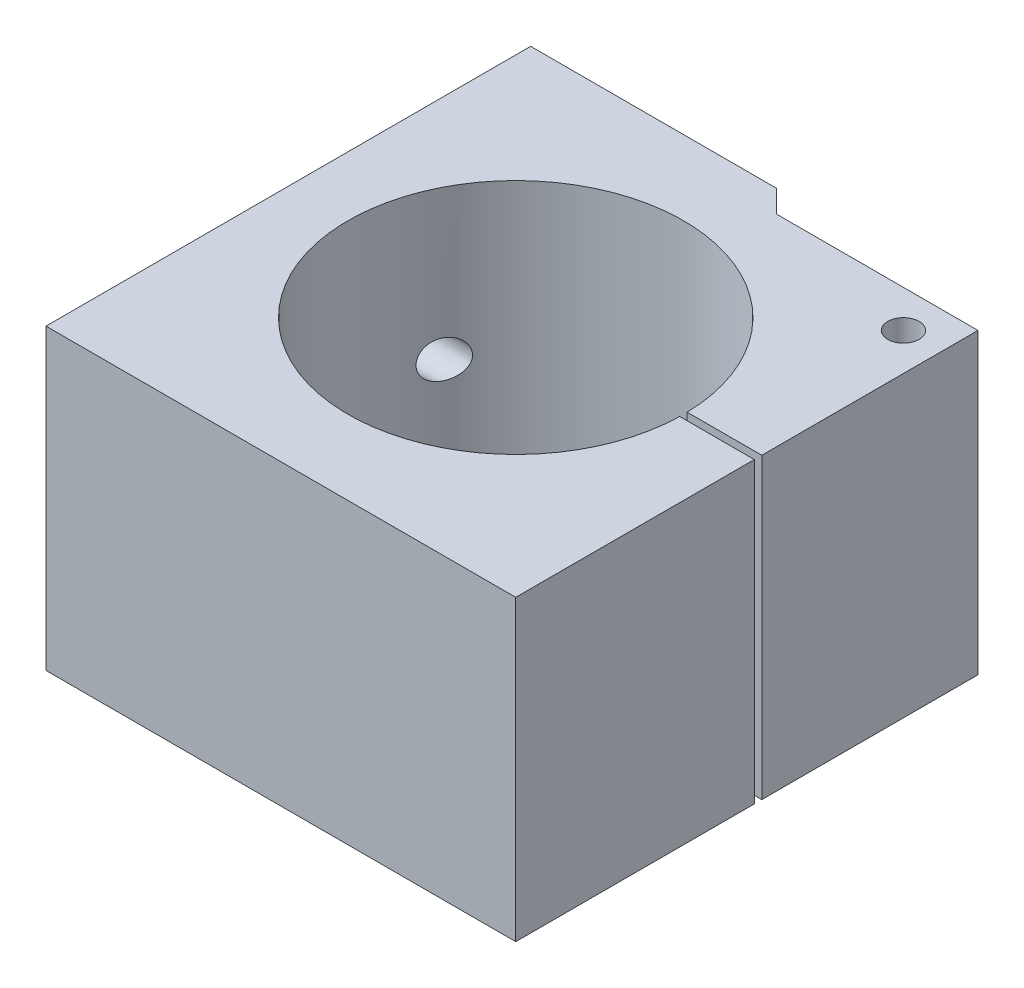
ISO-10303-21;
HEADER;
FILE_DESCRIPTION(('STEP AP214'),'2;1');
FILE_NAME('part.step','',(''),(''),'','','');
FILE_SCHEMA(('AUTOMOTIVE_DESIGN { 1 0 10303 214 1 1 1 1 }'));
ENDSEC;
DATA;
#1=APPLICATION_CONTEXT('core data for automotive mechanical design processes');
#2=APPLICATION_PROTOCOL_DEFINITION('international standard','automotive_design',2000,#1);
#3=PRODUCT_CONTEXT('',#1,'mechanical');
#4=PRODUCT('Part','Part','',(#3));
#5=PRODUCT_RELATED_PRODUCT_CATEGORY('part','',(#4));
#6=PRODUCT_DEFINITION_FORMATION('','',#4);
#7=PRODUCT_DEFINITION_CONTEXT('part definition',#1,'design');
#8=PRODUCT_DEFINITION('design','',#6,#7);
#9=PRODUCT_DEFINITION_SHAPE('','',#8);
#10=(LENGTH_UNIT() NAMED_UNIT(*) SI_UNIT(.MILLI.,.METRE.));
#11=(NAMED_UNIT(*) PLANE_ANGLE_UNIT() SI_UNIT($,.RADIAN.));
#12=(NAMED_UNIT(*) SI_UNIT($,.STERADIAN.) SOLID_ANGLE_UNIT());
#13=UNCERTAINTY_MEASURE_WITH_UNIT(LENGTH_MEASURE(1.E-05),#10,'distance_accuracy_value','');
#14=(GEOMETRIC_REPRESENTATION_CONTEXT(3) GLOBAL_UNCERTAINTY_ASSIGNED_CONTEXT((#13)) GLOBAL_UNIT_ASSIGNED_CONTEXT((#10,
#11,#12)) REPRESENTATION_CONTEXT('',''));
#15=CARTESIAN_POINT('',(0.,0.,0.));
#16=DIRECTION('',(0.,0.,1.));
#17=DIRECTION('',(1.,0.,0.));
#18=AXIS2_PLACEMENT_3D('',#15,#16,#17);
#19=CARTESIAN_POINT('',(32.5,40.,32.5));
#20=DIRECTION('',(-1.,0.,0.));
#21=DIRECTION('',(0.,0.,1.));
#22=AXIS2_PLACEMENT_3D('',#19,#20,#21);
#23=PLANE('',#22);
#24=DIRECTION('',(0.,-1.,0.));
#25=VECTOR('',#24,1.);
#26=CARTESIAN_POINT('',(32.5,40.,-29.5));
#27=LINE('',#26,#25);
#28=CARTESIAN_POINT('',(32.5,40.,-29.5));
#29=VERTEX_POINT('',#28);
#30=CARTESIAN_POINT('',(32.5,0.,-29.5));
#31=VERTEX_POINT('',#30);
#32=EDGE_CURVE('E258',#29,#31,#27,.T.);
#33=ORIENTED_EDGE('',*,*,#32,.F.);
#34=DIRECTION('',(0.,0.,-1.));
#35=VECTOR('',#34,1.);
#36=CARTESIAN_POINT('',(32.5,40.,32.5));
#37=LINE('',#36,#35);
#38=CARTESIAN_POINT('',(32.5,40.,-0.500000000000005));
#39=VERTEX_POINT('',#38);
#40=EDGE_CURVE('E252',#39,#29,#37,.T.);
#41=ORIENTED_EDGE('',*,*,#40,.F.);
#42=DIRECTION('',(0.,1.,0.));
#43=VECTOR('',#42,1.);
#44=CARTESIAN_POINT('',(32.5,0.,-0.500000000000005));
#45=LINE('',#44,#43);
#46=CARTESIAN_POINT('',(32.5,0.,-0.500000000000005));
#47=VERTEX_POINT('',#46);
#48=EDGE_CURVE('E281',#47,#39,#45,.T.);
#49=ORIENTED_EDGE('',*,*,#48,.F.);
#50=DIRECTION('',(0.,0.,-1.));
#51=VECTOR('',#50,1.);
#52=CARTESIAN_POINT('',(32.5,0.,32.5));
#53=LINE('',#52,#51);
#54=EDGE_CURVE('E243',#47,#31,#53,.T.);
#55=ORIENTED_EDGE('',*,*,#54,.T.);
#56=EDGE_LOOP('',(#33,#41,#49,#55));
#57=FACE_BOUND('',#56,.T.);
#58=ADVANCED_FACE('F43',(#57),#23,.F.);
#59=CARTESIAN_POINT('',(-32.5,40.,-32.5));
#60=DIRECTION('',(0.,0.,1.));
#61=DIRECTION('',(1.,0.,0.));
#62=AXIS2_PLACEMENT_3D('',#59,#60,#61);
#63=PLANE('',#62);
#64=DIRECTION('',(-1.,0.,0.));
#65=VECTOR('',#64,1.);
#66=CARTESIAN_POINT('',(-32.5,40.,-32.5));
#67=LINE('',#66,#65);
#68=CARTESIAN_POINT('',(2.49999999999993,40.,-32.5));
#69=VERTEX_POINT('',#68);
#70=CARTESIAN_POINT('',(-30.5,40.,-32.5));
#71=VERTEX_POINT('',#70);
#72=EDGE_CURVE('E121',#69,#71,#67,.T.);
#73=ORIENTED_EDGE('',*,*,#72,.F.);
#74=DIRECTION('',(0.,-1.,0.));
#75=VECTOR('',#74,1.);
#76=CARTESIAN_POINT('',(2.49999999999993,40.,-32.5));
#77=LINE('',#76,#75);
#78=CARTESIAN_POINT('',(2.49999999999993,0.,-32.5));
#79=VERTEX_POINT('',#78);
#80=EDGE_CURVE('E255',#69,#79,#77,.T.);
#81=ORIENTED_EDGE('',*,*,#80,.T.);
#82=DIRECTION('',(-1.,0.,0.));
#83=VECTOR('',#82,1.);
#84=CARTESIAN_POINT('',(-32.5,0.,-32.5));
#85=LINE('',#84,#83);
#86=CARTESIAN_POINT('',(-30.5,0.,-32.5));
#87=VERTEX_POINT('',#86);
#88=EDGE_CURVE('E136',#79,#87,#85,.T.);
#89=ORIENTED_EDGE('',*,*,#88,.T.);
#90=DIRECTION('',(0.,-1.,0.));
#91=VECTOR('',#90,1.);
#92=CARTESIAN_POINT('',(-30.5,40.,-32.5));
#93=LINE('',#92,#91);
#94=EDGE_CURVE('E133',#71,#87,#93,.T.);
#95=ORIENTED_EDGE('',*,*,#94,.F.);
#96=EDGE_LOOP('',(#73,#81,#89,#95));
#97=FACE_BOUND('',#96,.T.);
#98=ADVANCED_FACE('F134',(#97),#63,.F.);
#99=CARTESIAN_POINT('',(-32.5,40.,32.5));
#100=DIRECTION('',(0.,0.,-1.));
#101=DIRECTION('',(-1.,0.,0.));
#102=AXIS2_PLACEMENT_3D('',#99,#100,#101);
#103=PLANE('',#102);
#104=DIRECTION('',(1.,0.,0.));
#105=VECTOR('',#104,1.);
#106=CARTESIAN_POINT('',(-32.5,40.,32.5));
#107=LINE('',#106,#105);
#108=CARTESIAN_POINT('',(-30.5,40.,32.5));
#109=VERTEX_POINT('',#108);
#110=CARTESIAN_POINT('',(32.5,40.,32.5));
#111=VERTEX_POINT('',#110);
#112=EDGE_CURVE('E129',#109,#111,#107,.T.);
#113=ORIENTED_EDGE('',*,*,#112,.F.);
#114=DIRECTION('',(0.,1.,0.));
#115=VECTOR('',#114,1.);
#116=CARTESIAN_POINT('',(-30.5,0.,32.5));
#117=LINE('',#116,#115);
#118=CARTESIAN_POINT('',(-30.5,0.,32.5));
#119=VERTEX_POINT('',#118);
#120=EDGE_CURVE('E146',#119,#109,#117,.T.);
#121=ORIENTED_EDGE('',*,*,#120,.F.);
#122=DIRECTION('',(1.,0.,0.));
#123=VECTOR('',#122,1.);
#124=CARTESIAN_POINT('',(-32.5,0.,32.5));
#125=LINE('',#124,#123);
#126=CARTESIAN_POINT('',(32.5,0.,32.5));
#127=VERTEX_POINT('',#126);
#128=EDGE_CURVE('E245',#119,#127,#125,.T.);
#129=ORIENTED_EDGE('',*,*,#128,.T.);
#130=DIRECTION('',(0.,-1.,0.));
#131=VECTOR('',#130,1.);
#132=CARTESIAN_POINT('',(32.5,40.,32.5));
#133=LINE('',#132,#131);
#134=EDGE_CURVE('E241',#111,#127,#133,.T.);
#135=ORIENTED_EDGE('',*,*,#134,.F.);
#136=EDGE_LOOP('',(#113,#121,#129,#135));
#137=FACE_BOUND('',#136,.T.);
#138=ADVANCED_FACE('F221',(#137),#103,.F.);
#139=CARTESIAN_POINT('',(0.,40.,0.));
#140=DIRECTION('',(0.,-1.,0.));
#141=DIRECTION('',(0.,0.,-1.));
#142=AXIS2_PLACEMENT_3D('',#139,#140,#141);
#143=PLANE('',#142);
#144=CARTESIAN_POINT('',(27.5,40.,-24.5));
#145=DIRECTION('',(0.,1.,0.));
#146=DIRECTION('',(0.,0.,1.));
#147=AXIS2_PLACEMENT_3D('',#144,#145,#146);
#148=CIRCLE('',#147,2.1);
#149=CARTESIAN_POINT('',(27.5,40.,-22.4));
#150=VERTEX_POINT('',#149);
#151=EDGE_CURVE('E296',#150,#150,#148,.T.);
#152=ORIENTED_EDGE('',*,*,#151,.F.);
#153=EDGE_LOOP('',(#152));
#154=FACE_BOUND('',#153,.T.);
#155=DIRECTION('',(1.,0.,0.));
#156=VECTOR('',#155,1.);
#157=CARTESIAN_POINT('',(32.5,40.,-29.5));
#158=LINE('',#157,#156);
#159=CARTESIAN_POINT('',(5.4999999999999,40.,-29.5));
#160=VERTEX_POINT('',#159);
#161=EDGE_CURVE('E257',#160,#29,#158,.T.);
#162=ORIENTED_EDGE('',*,*,#161,.F.);
#163=DIRECTION('',(0.707106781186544,0.,0.707106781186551));
#164=VECTOR('',#163,1.);
#165=CARTESIAN_POINT('',(12.5,40.,-22.4999999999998));
#166=LINE('',#165,#164);
#167=EDGE_CURVE('E127',#160,#69,#166,.F.);
#168=ORIENTED_EDGE('',*,*,#167,.T.);
#169=ORIENTED_EDGE('',*,*,#72,.T.);
#170=DIRECTION('',(0.,0.,-1.));
#171=VECTOR('',#170,1.);
#172=CARTESIAN_POINT('',(-30.5,40.,32.5));
#173=LINE('',#172,#171);
#174=EDGE_CURVE('E125',#109,#71,#173,.T.);
#175=ORIENTED_EDGE('',*,*,#174,.F.);
#176=ORIENTED_EDGE('',*,*,#112,.T.);
#177=CARTESIAN_POINT('',(32.5,40.,0.499999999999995));
#178=VERTEX_POINT('',#177);
#179=EDGE_CURVE('E130',#111,#178,#37,.T.);
#180=ORIENTED_EDGE('',*,*,#179,.T.);
#181=DIRECTION('',(1.,0.,0.));
#182=VECTOR('',#181,1.);
#183=CARTESIAN_POINT('',(-32.501,40.,0.499999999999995));
#184=LINE('',#183,#182);
#185=CARTESIAN_POINT('',(22.494443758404,40.,0.49999999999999));
#186=VERTEX_POINT('',#185);
#187=EDGE_CURVE('E278',#186,#178,#184,.T.);
#188=ORIENTED_EDGE('',*,*,#187,.F.);
#189=CARTESIAN_POINT('',(0.,40.,0.));
#190=DIRECTION('',(0.,1.,0.));
#191=DIRECTION('',(0.,0.,1.));
#192=AXIS2_PLACEMENT_3D('',#189,#190,#191);
#193=CIRCLE('',#192,22.5);
#194=CARTESIAN_POINT('',(22.494443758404,40.,-0.500000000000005));
#195=VERTEX_POINT('',#194);
#196=EDGE_CURVE('E248',#195,#186,#193,.T.);
#197=ORIENTED_EDGE('',*,*,#196,.F.);
#198=DIRECTION('',(1.,0.,0.));
#199=VECTOR('',#198,1.);
#200=CARTESIAN_POINT('',(-32.501,40.,-0.500000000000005));
#201=LINE('',#200,#199);
#202=EDGE_CURVE('E268',#195,#39,#201,.T.);
#203=ORIENTED_EDGE('',*,*,#202,.T.);
#204=ORIENTED_EDGE('',*,*,#40,.T.);
#205=EDGE_LOOP('',(#162,#168,#169,#175,#176,#180,#188,#197,#203,#204));
#206=FACE_BOUND('',#205,.T.);
#207=ADVANCED_FACE('F123',(#154,#206),#143,.F.);
#208=CARTESIAN_POINT('',(0.,0.,0.));
#209=DIRECTION('',(0.,-1.,0.));
#210=DIRECTION('',(0.,0.,-1.));
#211=AXIS2_PLACEMENT_3D('',#208,#209,#210);
#212=PLANE('',#211);
#213=DIRECTION('',(-0.707106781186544,0.,-0.707106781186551));
#214=VECTOR('',#213,1.);
#215=CARTESIAN_POINT('',(17.5,0.,-17.4999999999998));
#216=LINE('',#215,#214);
#217=CARTESIAN_POINT('',(5.4999999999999,0.,-29.5));
#218=VERTEX_POINT('',#217);
#219=EDGE_CURVE('E52',#79,#218,#216,.F.);
#220=ORIENTED_EDGE('',*,*,#219,.T.);
#221=DIRECTION('',(-1.,0.,0.));
#222=VECTOR('',#221,1.);
#223=CARTESIAN_POINT('',(32.5,0.,-29.5));
#224=LINE('',#223,#222);
#225=EDGE_CURVE('E58',#31,#218,#224,.T.);
#226=ORIENTED_EDGE('',*,*,#225,.F.);
#227=ORIENTED_EDGE('',*,*,#54,.F.);
#228=DIRECTION('',(1.,0.,0.));
#229=VECTOR('',#228,1.);
#230=CARTESIAN_POINT('',(-32.501,0.,-0.500000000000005));
#231=LINE('',#230,#229);
#232=CARTESIAN_POINT('',(22.494443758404,0.,-0.500000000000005));
#233=VERTEX_POINT('',#232);
#234=EDGE_CURVE('E283',#233,#47,#231,.T.);
#235=ORIENTED_EDGE('',*,*,#234,.F.);
#236=CARTESIAN_POINT('',(0.,0.,0.));
#237=DIRECTION('',(0.,-1.,0.));
#238=DIRECTION('',(0.,0.,-1.));
#239=AXIS2_PLACEMENT_3D('',#236,#237,#238);
#240=CIRCLE('',#239,22.5);
#241=CARTESIAN_POINT('',(22.494443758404,0.,0.49999999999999));
#242=VERTEX_POINT('',#241);
#243=EDGE_CURVE('E271',#233,#242,#240,.F.);
#244=ORIENTED_EDGE('',*,*,#243,.T.);
#245=DIRECTION('',(1.,0.,0.));
#246=VECTOR('',#245,1.);
#247=CARTESIAN_POINT('',(-32.501,0.,0.49999999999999));
#248=LINE('',#247,#246);
#249=CARTESIAN_POINT('',(32.5,0.,0.49999999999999));
#250=VERTEX_POINT('',#249);
#251=EDGE_CURVE('E280',#242,#250,#248,.T.);
#252=ORIENTED_EDGE('',*,*,#251,.T.);
#253=EDGE_CURVE('E236',#127,#250,#53,.T.);
#254=ORIENTED_EDGE('',*,*,#253,.F.);
#255=ORIENTED_EDGE('',*,*,#128,.F.);
#256=DIRECTION('',(0.,0.,1.));
#257=VECTOR('',#256,1.);
#258=CARTESIAN_POINT('',(-30.5,0.,-32.5));
#259=LINE('',#258,#257);
#260=EDGE_CURVE('E140',#87,#119,#259,.T.);
#261=ORIENTED_EDGE('',*,*,#260,.F.);
#262=ORIENTED_EDGE('',*,*,#88,.F.);
#263=EDGE_LOOP('',(#220,#226,#227,#235,#244,#252,#254,#255,#261,#262));
#264=FACE_BOUND('',#263,.T.);
#265=ADVANCED_FACE('F225',(#264),#212,.T.);
#266=ORIENTED_EDGE('',*,*,#253,.T.);
#267=DIRECTION('',(0.,-1.,0.));
#268=VECTOR('',#267,1.);
#269=CARTESIAN_POINT('',(32.5,40.,0.499999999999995));
#270=LINE('',#269,#268);
#271=EDGE_CURVE('E238',#178,#250,#270,.T.);
#272=ORIENTED_EDGE('',*,*,#271,.F.);
#273=ORIENTED_EDGE('',*,*,#179,.F.);
#274=ORIENTED_EDGE('',*,*,#134,.T.);
#275=EDGE_LOOP('',(#266,#272,#273,#274));
#276=FACE_BOUND('',#275,.T.);
#277=ADVANCED_FACE('F212',(#276),#23,.F.);
#278=CARTESIAN_POINT('',(0.,-0.001000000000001,0.));
#279=DIRECTION('',(0.,1.,0.));
#280=DIRECTION('',(0.,0.,1.));
#281=AXIS2_PLACEMENT_3D('',#278,#279,#280);
#282=CYLINDRICAL_SURFACE('',#281,22.5);
#283=CARTESIAN_POINT('',(-21.1231508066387,20.,-7.75));
#284=CARTESIAN_POINT('',(-21.12315005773,20.1335678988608,-7.75000416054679));
#285=CARTESIAN_POINT('',(-21.1192178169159,20.2671847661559,-7.76074551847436));
#286=CARTESIAN_POINT('',(-21.1035269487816,20.5305947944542,-7.80331001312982));
#287=CARTESIAN_POINT('',(-21.0917634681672,20.6603855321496,-7.83514622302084));
#288=CARTESIAN_POINT('',(-21.0605658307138,20.9122747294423,-7.91861950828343));
#289=CARTESIAN_POINT('',(-21.0411407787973,21.0343821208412,-7.97023307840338));
#290=CARTESIAN_POINT('',(-20.9948758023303,21.2678211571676,-8.09131448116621));
#291=CARTESIAN_POINT('',(-20.9680363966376,21.379153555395,-8.16078106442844));
#292=CARTESIAN_POINT('',(-20.9067240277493,21.5904642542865,-8.31661075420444));
#293=CARTESIAN_POINT('',(-20.8721113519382,21.690176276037,-8.40327921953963));
#294=CARTESIAN_POINT('',(-20.7961212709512,21.8735571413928,-8.58961312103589));
#295=CARTESIAN_POINT('',(-20.7547424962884,21.9572227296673,-8.68928118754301));
#296=CARTESIAN_POINT('',(-20.6633768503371,22.1113966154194,-8.90445145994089));
#297=CARTESIAN_POINT('',(-20.6130341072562,22.1808851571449,-9.02053198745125));
#298=CARTESIAN_POINT('',(-20.5065180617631,22.2995743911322,-9.26012526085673));
#299=CARTESIAN_POINT('',(-20.4503428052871,22.3487682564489,-9.38364049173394));
#300=CARTESIAN_POINT('',(-20.3283916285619,22.4298994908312,-9.64515199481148));
#301=CARTESIAN_POINT('',(-20.2622059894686,22.4600778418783,-9.78350215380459));
#302=CARTESIAN_POINT('',(-20.1257183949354,22.4968058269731,-10.0612846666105));
#303=CARTESIAN_POINT('',(-20.0554149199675,22.5033466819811,-10.2007174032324));
#304=CARTESIAN_POINT('',(-19.9057496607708,22.4930306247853,-10.4899935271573));
#305=CARTESIAN_POINT('',(-19.8261444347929,22.4739990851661,-10.6396349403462));
#306=CARTESIAN_POINT('',(-19.6660358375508,22.4096466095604,-10.9327478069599));
#307=CARTESIAN_POINT('',(-19.5855318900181,22.3643077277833,-11.0762149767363));
#308=CARTESIAN_POINT('',(-19.4214832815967,22.2449418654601,-11.3615400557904));
#309=CARTESIAN_POINT('',(-19.3380320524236,22.1694073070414,-11.5028249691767));
#310=CARTESIAN_POINT('',(-19.1763562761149,21.9910440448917,-11.770376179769));
#311=CARTESIAN_POINT('',(-19.098127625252,21.8882370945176,-11.8966543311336));
#312=CARTESIAN_POINT('',(-18.9654464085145,21.6792453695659,-12.1067832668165));
#313=CARTESIAN_POINT('',(-18.909327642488,21.5775992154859,-12.1941102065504));
#314=CARTESIAN_POINT('',(-18.805896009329,21.3585014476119,-12.3530261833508));
#315=CARTESIAN_POINT('',(-18.7585791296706,21.2410570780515,-12.424622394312));
#316=CARTESIAN_POINT('',(-18.6963581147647,21.0543186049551,-12.5178918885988));
#317=CARTESIAN_POINT('',(-18.6770065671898,20.989981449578,-12.5467296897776));
#318=CARTESIAN_POINT('',(-18.6417105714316,20.8583030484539,-12.5991119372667));
#319=CARTESIAN_POINT('',(-18.6257642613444,20.7909634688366,-12.6226592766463));
#320=CARTESIAN_POINT('',(-18.5976477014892,20.6538294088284,-12.664048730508));
#321=CARTESIAN_POINT('',(-18.5854749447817,20.5840365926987,-12.6818946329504));
#322=CARTESIAN_POINT('',(-18.5651938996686,20.442632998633,-12.7115652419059));
#323=CARTESIAN_POINT('',(-18.5570848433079,20.3710225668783,-12.7233910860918));
#324=CARTESIAN_POINT('',(-18.5409212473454,20.1752256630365,-12.7469455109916));
#325=CARTESIAN_POINT('',(-18.5370099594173,20.0498802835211,-12.7526191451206));
#326=CARTESIAN_POINT('',(-18.5421589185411,19.8001237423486,-12.7451304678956));
#327=CARTESIAN_POINT('',(-18.5512149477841,19.6757122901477,-12.731974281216));
#328=CARTESIAN_POINT('',(-18.5804771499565,19.4400632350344,-12.6892264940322));
#329=CARTESIAN_POINT('',(-18.5998799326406,19.328506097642,-12.6608182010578));
#330=CARTESIAN_POINT('',(-18.6480141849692,19.1121665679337,-12.5898131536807));
#331=CARTESIAN_POINT('',(-18.676747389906,19.007385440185,-12.5472137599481));
#332=CARTESIAN_POINT('',(-18.7443973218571,18.7990787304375,-12.445944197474));
#333=CARTESIAN_POINT('',(-18.7839073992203,18.696211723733,-12.3863228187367));
#334=CARTESIAN_POINT('',(-18.8699410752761,18.5018893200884,-12.2548560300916));
#335=CARTESIAN_POINT('',(-18.9164681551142,18.4104396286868,-12.1830045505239));
#336=CARTESIAN_POINT('',(-19.0223214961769,18.2266712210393,-12.0171696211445));
#337=CARTESIAN_POINT('',(-19.0825151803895,18.1363913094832,-11.9214818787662));
#338=CARTESIAN_POINT('',(-19.2074781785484,17.97299962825,-11.719085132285));
#339=CARTESIAN_POINT('',(-19.2722502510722,17.8998983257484,-11.6123694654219));
#340=CARTESIAN_POINT('',(-19.4145541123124,17.7615701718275,-11.3730943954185));
#341=CARTESIAN_POINT('',(-19.4925163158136,17.6992830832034,-11.2390844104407));
#342=CARTESIAN_POINT('',(-19.6493163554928,17.5992165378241,-10.9626482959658));
#343=CARTESIAN_POINT('',(-19.7281546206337,17.5614496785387,-10.8202178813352));
#344=CARTESIAN_POINT('',(-19.8906047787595,17.5094363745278,-10.5188088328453));
#345=CARTESIAN_POINT('',(-19.9741077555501,17.4972605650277,-10.3594071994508));
#346=CARTESIAN_POINT('',(-20.1370104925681,17.5037700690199,-10.0390778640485));
#347=CARTESIAN_POINT('',(-20.2164103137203,17.52245492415,-9.87815018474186));
#348=CARTESIAN_POINT('',(-20.3668396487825,17.5907143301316,-9.56406785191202));
#349=CARTESIAN_POINT('',(-20.4380304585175,17.6394928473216,-9.41081957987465));
#350=CARTESIAN_POINT('',(-20.5722680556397,17.7673361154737,-9.11363495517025));
#351=CARTESIAN_POINT('',(-20.6353198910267,17.846381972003,-8.96969285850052));
#352=CARTESIAN_POINT('',(-20.7462954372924,18.0251104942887,-8.70973233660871));
#353=CARTESIAN_POINT('',(-20.7950689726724,18.1223046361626,-8.59236724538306));
#354=CARTESIAN_POINT('',(-20.8832963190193,18.3386062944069,-8.37565758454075));
#355=CARTESIAN_POINT('',(-20.9227546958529,18.4577030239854,-8.27630419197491));
#356=CARTESIAN_POINT('',(-20.9883415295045,18.7024153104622,-8.10844726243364));
#357=CARTESIAN_POINT('',(-21.0153614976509,18.8264271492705,-8.03794825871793));
#358=CARTESIAN_POINT('',(-21.0605720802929,19.0859201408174,-7.91873728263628));
#359=CARTESIAN_POINT('',(-21.0787725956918,19.221388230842,-7.87000088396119));
#360=CARTESIAN_POINT('',(-21.1026533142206,19.4643142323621,-7.80569432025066));
#361=CARTESIAN_POINT('',(-21.11033369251,19.5702175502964,-7.78485900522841));
#362=CARTESIAN_POINT('',(-21.1205825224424,19.7840700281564,-7.7570107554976));
#363=CARTESIAN_POINT('',(-21.1231514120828,19.8920190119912,-7.74999663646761));
#364=CARTESIAN_POINT('',(-21.1231508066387,20.,-7.75));
#365=B_SPLINE_CURVE_WITH_KNOTS('',3,(#283,#284,#285,#286,#287,#288,#289,#290,#291,#292,#293,
#294,#295,#296,#297,#298,#299,#300,#301,#302,#303,#304,#305,#306,#307,#308,#309,#310,#311,#312,
#313,#314,#315,#316,#317,#318,#319,#320,#321,#322,#323,#324,#325,#326,#327,#328,#329,#330,#331,
#332,#333,#334,#335,#336,#337,#338,#339,#340,#341,#342,#343,#344,#345,#346,#347,#348,#349,#350,
#351,#352,#353,#354,#355,#356,#357,#358,#359,#360,#361,#362,#363,#364),.UNSPECIFIED.,.T.,.F.,(4,
2,2,2,2,2,2,2,2,2,2,2,2,2,2,2,2,2,2,2,2,2,2,2,2,2,2,2,2,2,2,2,2,2,2,2,2,2,2,2,4),(0.,
0.400305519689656,0.800859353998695,1.20093860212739,1.60098985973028,2.00890677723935,
2.41690636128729,2.84812524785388,3.27948907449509,3.74644944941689,4.21358323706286,
4.72306024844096,5.23288521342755,5.77219710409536,6.31108010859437,6.74524457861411,
7.17921063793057,7.39827100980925,7.61721129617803,7.83600581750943,8.05475897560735,
8.42914363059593,8.80340653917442,9.15211967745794,9.50089770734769,9.87531592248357,
10.2499205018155,10.6822664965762,11.1148752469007,11.6140121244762,12.113405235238,
12.6518574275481,13.1903016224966,13.7150798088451,14.2395309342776,14.7169178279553,
15.1940702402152,15.627392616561,16.0602274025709,16.3838762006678,16.7074972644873),.UNSPECIFIED.);
#366=CARTESIAN_POINT('',(-21.1231508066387,20.,-7.75));
#367=VERTEX_POINT('',#366);
#368=EDGE_CURVE('E164',#367,#367,#365,.T.);
#369=ORIENTED_EDGE('',*,*,#368,.T.);
#370=EDGE_LOOP('',(#369));
#371=FACE_BOUND('',#370,.T.);
#372=CARTESIAN_POINT('',(-18.5388106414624,20.,12.75));
#373=CARTESIAN_POINT('',(-18.5388157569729,20.1236585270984,12.7499939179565));
#374=CARTESIAN_POINT('',(-18.5451698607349,20.2473707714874,12.7407686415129));
#375=CARTESIAN_POINT('',(-18.5700836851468,20.4909011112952,12.7044264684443));
#376=CARTESIAN_POINT('',(-18.5886532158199,20.6107159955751,12.6772951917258));
#377=CARTESIAN_POINT('',(-18.6365028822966,20.842556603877,12.6068451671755));
#378=CARTESIAN_POINT('',(-18.6657350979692,20.954614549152,12.5635988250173));
#379=CARTESIAN_POINT('',(-18.7331064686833,21.1692089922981,12.4629200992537));
#380=CARTESIAN_POINT('',(-18.7712474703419,21.2717435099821,12.405484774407));
#381=CARTESIAN_POINT('',(-18.8576849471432,21.4731186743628,12.2737266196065));
#382=CARTESIAN_POINT('',(-18.9065294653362,21.5711015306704,12.1984585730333));
#383=CARTESIAN_POINT('',(-19.0101743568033,21.7532887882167,12.0363009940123));
#384=CARTESIAN_POINT('',(-19.0649774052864,21.8374869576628,11.9494062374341));
#385=CARTESIAN_POINT('',(-19.1882066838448,22.0043654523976,11.7506828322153));
#386=CARTESIAN_POINT('',(-19.2573772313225,22.0844292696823,11.6371156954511));
#387=CARTESIAN_POINT('',(-19.3988062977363,22.2241737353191,11.3997997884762));
#388=CARTESIAN_POINT('',(-19.4710667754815,22.2838412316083,11.2760445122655));
#389=CARTESIAN_POINT('',(-19.6258098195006,22.3883109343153,11.0047672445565));
#390=CARTESIAN_POINT('',(-19.7084279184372,22.4302732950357,10.8562202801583));
#391=CARTESIAN_POINT('',(-19.8723371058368,22.4863276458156,10.5531944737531));
#392=CARTESIAN_POINT('',(-19.9536277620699,22.5004107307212,10.3987137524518));
#393=CARTESIAN_POINT('',(-20.1149397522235,22.4995587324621,10.0832276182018));
#394=CARTESIAN_POINT('',(-20.1948505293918,22.4837437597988,9.92216519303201));
#395=CARTESIAN_POINT('',(-20.3484211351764,22.4203615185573,9.60328288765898));
#396=CARTESIAN_POINT('',(-20.4220830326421,22.3728048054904,9.44546194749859));
#397=CARTESIAN_POINT('',(-20.5566344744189,22.2497582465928,9.14875263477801));
#398=CARTESIAN_POINT('',(-20.6180347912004,22.1762022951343,9.00929751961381));
#399=CARTESIAN_POINT('',(-20.7318111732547,22.0019881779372,8.74430039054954));
#400=CARTESIAN_POINT('',(-20.7841933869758,21.9013485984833,8.61874891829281));
#401=CARTESIAN_POINT('',(-20.8739972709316,21.6864687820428,8.3987504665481));
#402=CARTESIAN_POINT('',(-20.9123796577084,21.5745114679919,8.30246429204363));
#403=CARTESIAN_POINT('',(-20.9799622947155,21.3335101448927,8.13017657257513));
#404=CARTESIAN_POINT('',(-21.0091673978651,21.2044752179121,8.05416431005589));
#405=CARTESIAN_POINT('',(-21.0559362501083,20.9442104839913,7.93105013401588));
#406=CARTESIAN_POINT('',(-21.0742411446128,20.8139714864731,7.882129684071));
#407=CARTESIAN_POINT('',(-21.1023852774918,20.5463351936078,7.8064707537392));
#408=CARTESIAN_POINT('',(-21.1122270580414,20.408940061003,7.7797256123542));
#409=CARTESIAN_POINT('',(-21.1230802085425,20.1373850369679,7.75020744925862));
#410=CARTESIAN_POINT('',(-21.124459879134,20.0033474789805,7.74643464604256));
#411=CARTESIAN_POINT('',(-21.119357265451,19.7365500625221,7.76033526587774));
#412=CARTESIAN_POINT('',(-21.1128758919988,19.6037900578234,7.77800620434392));
#413=CARTESIAN_POINT('',(-21.0922432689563,19.3448378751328,7.83378155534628));
#414=CARTESIAN_POINT('',(-21.0781787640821,19.2185887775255,7.87165481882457));
#415=CARTESIAN_POINT('',(-21.0426068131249,18.9745007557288,7.96625610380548));
#416=CARTESIAN_POINT('',(-21.0210991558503,18.8566620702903,8.02298466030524));
#417=CARTESIAN_POINT('',(-20.9704783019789,18.6303898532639,8.1543891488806));
#418=CARTESIAN_POINT('',(-20.9412378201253,18.5221585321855,8.22936359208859));
#419=CARTESIAN_POINT('',(-20.8757717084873,18.3199878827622,8.39404502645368));
#420=CARTESIAN_POINT('',(-20.8395449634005,18.2260508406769,8.48375436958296));
#421=CARTESIAN_POINT('',(-20.7588370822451,18.0502889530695,8.67942225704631));
#422=CARTESIAN_POINT('',(-20.714050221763,17.9692314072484,8.78594278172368));
#423=CARTESIAN_POINT('',(-20.6182545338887,17.8260432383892,9.00845475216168));
#424=CARTESIAN_POINT('',(-20.5672439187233,17.7639180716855,9.12444891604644));
#425=CARTESIAN_POINT('',(-20.455924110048,17.6552703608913,9.37149050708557));
#426=CARTESIAN_POINT('',(-20.3952052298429,17.6102559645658,9.5030155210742));
#427=CARTESIAN_POINT('',(-20.2689267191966,17.5427668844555,9.76946156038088));
#428=CARTESIAN_POINT('',(-20.2033651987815,17.5203010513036,9.90438389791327));
#429=CARTESIAN_POINT('',(-20.0626176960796,17.4964347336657,10.1866789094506));
#430=CARTESIAN_POINT('',(-19.9870993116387,17.497142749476,10.334064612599));
#431=CARTESIAN_POINT('',(-19.8338079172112,17.5240043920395,10.6253091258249));
#432=CARTESIAN_POINT('',(-19.7560340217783,17.5501681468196,10.7691665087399));
#433=CARTESIAN_POINT('',(-19.5944083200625,17.6299158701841,11.0606944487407));
#434=CARTESIAN_POINT('',(-19.5105402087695,17.6854177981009,11.2078352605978));
#435=CARTESIAN_POINT('',(-19.3454326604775,17.8237666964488,11.4904768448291));
#436=CARTESIAN_POINT('',(-19.2641951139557,17.9066328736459,11.6259693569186));
#437=CARTESIAN_POINT('',(-19.1076779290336,18.0989518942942,11.8814626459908));
#438=CARTESIAN_POINT('',(-19.0324164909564,18.2084821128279,12.0014167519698));
#439=CARTESIAN_POINT('',(-18.8926209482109,18.4525316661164,12.2202994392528));
#440=CARTESIAN_POINT('',(-18.828066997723,18.5870037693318,12.3192670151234));
#441=CARTESIAN_POINT('',(-18.7309359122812,18.83684784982,12.4662549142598));
#442=CARTESIAN_POINT('',(-18.694474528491,18.9469171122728,12.5207724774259));
#443=CARTESIAN_POINT('',(-18.6319309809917,19.1763621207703,12.6136551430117));
#444=CARTESIAN_POINT('',(-18.605831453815,19.2957218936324,12.6520472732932));
#445=CARTESIAN_POINT('',(-18.5704128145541,19.5126198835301,12.7039565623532));
#446=CARTESIAN_POINT('',(-18.5586183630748,19.6088869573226,12.7211587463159));
#447=CARTESIAN_POINT('',(-18.5428149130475,19.8034245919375,12.7441833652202));
#448=CARTESIAN_POINT('',(-18.5388065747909,19.9016953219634,12.7500048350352));
#449=CARTESIAN_POINT('',(-18.5388106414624,20.,12.75));
#450=B_SPLINE_CURVE_WITH_KNOTS('',3,(#372,#373,#374,#375,#376,#377,#378,#379,#380,#381,#382,
#383,#384,#385,#386,#387,#388,#389,#390,#391,#392,#393,#394,#395,#396,#397,#398,#399,#400,#401,
#402,#403,#404,#405,#406,#407,#408,#409,#410,#411,#412,#413,#414,#415,#416,#417,#418,#419,#420,
#421,#422,#423,#424,#425,#426,#427,#428,#429,#430,#431,#432,#433,#434,#435,#436,#437,#438,#439,
#440,#441,#442,#443,#444,#445,#446,#447,#448,#449),.UNSPECIFIED.,.T.,.F.,(4,2,2,2,2,2,2,2,2,2,2,
2,2,2,2,2,2,2,2,2,2,2,2,2,2,2,2,2,2,2,2,2,2,2,2,2,2,2,4),(0.,0.37058004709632,0.741458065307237,
1.11068942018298,1.47999737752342,1.87708066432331,2.27434297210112,2.73814650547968,
3.20224854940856,3.725130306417,4.24817905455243,4.7868609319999,5.32536376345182,
5.83017352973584,6.33463774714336,6.78991436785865,7.24494983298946,7.66379428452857,
8.08251287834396,8.48287007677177,8.88318089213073,9.27900673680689,9.67484381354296,
10.0776528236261,10.480526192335,10.902151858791,11.3238989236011,11.7770821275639,
12.2304431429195,12.725159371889,13.2200725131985,13.7522856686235,14.2848731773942,
14.8190249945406,15.3521754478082,15.7350226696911,16.1172256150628,16.4118002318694,
16.7063998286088),.UNSPECIFIED.);
#451=CARTESIAN_POINT('',(-18.5388106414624,20.,12.75));
#452=VERTEX_POINT('',#451);
#453=EDGE_CURVE('E156',#452,#452,#450,.T.);
#454=ORIENTED_EDGE('',*,*,#453,.T.);
#455=EDGE_LOOP('',(#454));
#456=FACE_BOUND('',#455,.T.);
#457=ORIENTED_EDGE('',*,*,#243,.F.);
#458=DIRECTION('',(0.,1.,0.));
#459=VECTOR('',#458,1.);
#460=CARTESIAN_POINT('',(22.494443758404,-0.001000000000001,-0.500000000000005));
#461=LINE('',#460,#459);
#462=EDGE_CURVE('E260',#195,#233,#461,.F.);
#463=ORIENTED_EDGE('',*,*,#462,.F.);
#464=ORIENTED_EDGE('',*,*,#196,.T.);
#465=DIRECTION('',(0.,1.,0.));
#466=VECTOR('',#465,1.);
#467=CARTESIAN_POINT('',(22.494443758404,-0.00100000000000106,0.49999999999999));
#468=LINE('',#467,#466);
#469=EDGE_CURVE('E274',#242,#186,#468,.T.);
#470=ORIENTED_EDGE('',*,*,#469,.F.);
#471=EDGE_LOOP('',(#457,#463,#464,#470));
#472=FACE_BOUND('',#471,.T.);
#473=ADVANCED_FACE('F170',(#371,#456,#472),#282,.F.);
#474=CARTESIAN_POINT('',(-32.501,40.,0.499999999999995));
#475=DIRECTION('',(0.,0.,1.));
#476=DIRECTION('',(0.,-1.,0.));
#477=AXIS2_PLACEMENT_3D('',#474,#475,#476);
#478=PLANE('',#477);
#479=ORIENTED_EDGE('',*,*,#469,.T.);
#480=ORIENTED_EDGE('',*,*,#187,.T.);
#481=ORIENTED_EDGE('',*,*,#271,.T.);
#482=ORIENTED_EDGE('',*,*,#251,.F.);
#483=EDGE_LOOP('',(#479,#480,#481,#482));
#484=FACE_BOUND('',#483,.T.);
#485=ADVANCED_FACE('F204',(#484),#478,.F.);
#486=CARTESIAN_POINT('',(-32.501,0.,-0.500000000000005));
#487=DIRECTION('',(0.,0.,-1.));
#488=DIRECTION('',(0.,1.,0.));
#489=AXIS2_PLACEMENT_3D('',#486,#487,#488);
#490=PLANE('',#489);
#491=ORIENTED_EDGE('',*,*,#462,.T.);
#492=ORIENTED_EDGE('',*,*,#234,.T.);
#493=ORIENTED_EDGE('',*,*,#48,.T.);
#494=ORIENTED_EDGE('',*,*,#202,.F.);
#495=EDGE_LOOP('',(#491,#492,#493,#494));
#496=FACE_BOUND('',#495,.T.);
#497=ADVANCED_FACE('F201',(#496),#490,.F.);
#498=CARTESIAN_POINT('',(0.,0.,-29.5));
#499=DIRECTION('',(0.,0.,-1.));
#500=DIRECTION('',(-1.,0.,0.));
#501=AXIS2_PLACEMENT_3D('',#498,#499,#500);
#502=PLANE('',#501);
#503=CARTESIAN_POINT('',(13.4999999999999,32.,-29.5));
#504=DIRECTION('',(0.,0.,-1.));
#505=DIRECTION('',(-1.,0.,0.));
#506=AXIS2_PLACEMENT_3D('',#503,#504,#505);
#507=CIRCLE('',#506,5.);
#508=CARTESIAN_POINT('',(8.4999999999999,32.,-29.5));
#509=VERTEX_POINT('',#508);
#510=EDGE_CURVE('E290',#509,#509,#507,.T.);
#511=ORIENTED_EDGE('',*,*,#510,.F.);
#512=EDGE_LOOP('',(#511));
#513=FACE_BOUND('',#512,.T.);
#514=CARTESIAN_POINT('',(19.5,10.,-29.5));
#515=DIRECTION('',(0.,0.,-1.));
#516=DIRECTION('',(-1.,0.,0.));
#517=AXIS2_PLACEMENT_3D('',#514,#515,#516);
#518=CIRCLE('',#517,5.);
#519=CARTESIAN_POINT('',(14.5,10.,-29.5));
#520=VERTEX_POINT('',#519);
#521=EDGE_CURVE('E439',#520,#520,#518,.T.);
#522=ORIENTED_EDGE('',*,*,#521,.F.);
#523=EDGE_LOOP('',(#522));
#524=FACE_BOUND('',#523,.T.);
#525=ORIENTED_EDGE('',*,*,#32,.T.);
#526=ORIENTED_EDGE('',*,*,#225,.T.);
#527=DIRECTION('',(0.,-1.,0.));
#528=VECTOR('',#527,1.);
#529=CARTESIAN_POINT('',(5.4999999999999,40.,-29.5));
#530=LINE('',#529,#528);
#531=EDGE_CURVE('E11',#218,#160,#530,.F.);
#532=ORIENTED_EDGE('',*,*,#531,.T.);
#533=ORIENTED_EDGE('',*,*,#161,.T.);
#534=EDGE_LOOP('',(#525,#526,#532,#533));
#535=FACE_BOUND('',#534,.T.);
#536=ADVANCED_FACE('F198',(#513,#524,#535),#502,.T.);
#537=CARTESIAN_POINT('',(12.5,40.,-22.4999999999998));
#538=DIRECTION('',(-0.707106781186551,0.,0.707106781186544));
#539=DIRECTION('',(0.,1.,0.));
#540=AXIS2_PLACEMENT_3D('',#537,#538,#539);
#541=PLANE('',#540);
#542=ORIENTED_EDGE('',*,*,#219,.F.);
#543=ORIENTED_EDGE('',*,*,#80,.F.);
#544=ORIENTED_EDGE('',*,*,#167,.F.);
#545=ORIENTED_EDGE('',*,*,#531,.F.);
#546=EDGE_LOOP('',(#542,#543,#544,#545));
#547=FACE_BOUND('',#546,.T.);
#548=ADVANCED_FACE('F46',(#547),#541,.F.);
#549=CARTESIAN_POINT('',(13.4999999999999,32.,-22.));
#550=DIRECTION('',(0.,0.,-1.));
#551=DIRECTION('',(-1.,0.,0.));
#552=AXIS2_PLACEMENT_3D('',#549,#550,#551);
#553=CYLINDRICAL_SURFACE('',#552,5.);
#554=CARTESIAN_POINT('',(13.4999999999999,32.,-22.));
#555=DIRECTION('',(0.,0.,-1.));
#556=DIRECTION('',(-1.,0.,0.));
#557=AXIS2_PLACEMENT_3D('',#554,#555,#556);
#558=CIRCLE('',#557,5.);
#559=CARTESIAN_POINT('',(8.4999999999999,32.,-22.));
#560=VERTEX_POINT('',#559);
#561=EDGE_CURVE('E264',#560,#560,#558,.T.);
#562=ORIENTED_EDGE('',*,*,#561,.F.);
#563=EDGE_LOOP('',(#562));
#564=FACE_BOUND('',#563,.T.);
#565=ORIENTED_EDGE('',*,*,#510,.T.);
#566=EDGE_LOOP('',(#565));
#567=FACE_BOUND('',#566,.T.);
#568=ADVANCED_FACE('F193',(#564,#567),#553,.F.);
#569=CARTESIAN_POINT('',(0.,0.,-22.));
#570=DIRECTION('',(0.,0.,-1.));
#571=DIRECTION('',(-1.,0.,0.));
#572=AXIS2_PLACEMENT_3D('',#569,#570,#571);
#573=PLANE('',#572);
#574=ORIENTED_EDGE('',*,*,#561,.T.);
#575=EDGE_LOOP('',(#574));
#576=FACE_BOUND('',#575,.T.);
#577=ADVANCED_FACE('F189',(#576),#573,.T.);
#578=CARTESIAN_POINT('',(27.5,30.,-24.5));
#579=DIRECTION('',(0.,1.,0.));
#580=DIRECTION('',(0.,0.,1.));
#581=AXIS2_PLACEMENT_3D('',#578,#579,#580);
#582=CYLINDRICAL_SURFACE('',#581,2.1);
#583=CARTESIAN_POINT('',(27.5,30.,-24.5));
#584=DIRECTION('',(0.,1.,0.));
#585=DIRECTION('',(0.,0.,1.));
#586=AXIS2_PLACEMENT_3D('',#583,#584,#585);
#587=CIRCLE('',#586,2.1);
#588=CARTESIAN_POINT('',(27.5,30.,-22.4));
#589=VERTEX_POINT('',#588);
#590=EDGE_CURVE('E293',#589,#589,#587,.T.);
#591=ORIENTED_EDGE('',*,*,#590,.F.);
#592=EDGE_LOOP('',(#591));
#593=FACE_BOUND('',#592,.T.);
#594=ORIENTED_EDGE('',*,*,#151,.T.);
#595=EDGE_LOOP('',(#594));
#596=FACE_BOUND('',#595,.T.);
#597=ADVANCED_FACE('F185',(#593,#596),#582,.F.);
#598=CARTESIAN_POINT('',(27.5,30.,-24.5));
#599=DIRECTION('',(0.,1.,0.));
#600=DIRECTION('',(0.,0.,1.));
#601=AXIS2_PLACEMENT_3D('',#598,#599,#600);
#602=PLANE('',#601);
#603=ORIENTED_EDGE('',*,*,#590,.T.);
#604=EDGE_LOOP('',(#603));
#605=FACE_BOUND('',#604,.T.);
#606=ADVANCED_FACE('F179',(#605),#602,.T.);
#607=CARTESIAN_POINT('',(-17.5,20.,10.25));
#608=DIRECTION('',(-1.,0.,0.));
#609=DIRECTION('',(0.,0.,1.));
#610=AXIS2_PLACEMENT_3D('',#607,#608,#609);
#611=CYLINDRICAL_SURFACE('',#610,2.5);
#612=ORIENTED_EDGE('',*,*,#453,.F.);
#613=EDGE_LOOP('',(#612));
#614=FACE_BOUND('',#613,.T.);
#615=CARTESIAN_POINT('',(-30.5,20.,10.25));
#616=DIRECTION('',(-1.,0.,0.));
#617=DIRECTION('',(0.,0.,1.));
#618=AXIS2_PLACEMENT_3D('',#615,#616,#617);
#619=CIRCLE('',#618,2.5);
#620=CARTESIAN_POINT('',(-30.5,20.,12.75));
#621=VERTEX_POINT('',#620);
#622=EDGE_CURVE('E150',#621,#621,#619,.T.);
#623=ORIENTED_EDGE('',*,*,#622,.T.);
#624=EDGE_LOOP('',(#623));
#625=FACE_BOUND('',#624,.T.);
#626=ADVANCED_FACE('F174',(#614,#625),#611,.F.);
#627=CARTESIAN_POINT('',(-17.5,20.,-10.25));
#628=DIRECTION('',(-1.,0.,0.));
#629=DIRECTION('',(0.,0.,1.));
#630=AXIS2_PLACEMENT_3D('',#627,#628,#629);
#631=CYLINDRICAL_SURFACE('',#630,2.5);
#632=ORIENTED_EDGE('',*,*,#368,.F.);
#633=EDGE_LOOP('',(#632));
#634=FACE_BOUND('',#633,.T.);
#635=CARTESIAN_POINT('',(-30.5,20.,-10.25));
#636=DIRECTION('',(-1.,0.,0.));
#637=DIRECTION('',(0.,0.,1.));
#638=AXIS2_PLACEMENT_3D('',#635,#636,#637);
#639=CIRCLE('',#638,2.5);
#640=CARTESIAN_POINT('',(-30.5,20.,-7.75));
#641=VERTEX_POINT('',#640);
#642=EDGE_CURVE('E147',#641,#641,#639,.T.);
#643=ORIENTED_EDGE('',*,*,#642,.T.);
#644=EDGE_LOOP('',(#643));
#645=FACE_BOUND('',#644,.T.);
#646=ADVANCED_FACE('F178',(#634,#645),#631,.F.);
#647=CARTESIAN_POINT('',(-30.5,0.,0.));
#648=DIRECTION('',(-1.,0.,0.));
#649=DIRECTION('',(0.,0.,1.));
#650=AXIS2_PLACEMENT_3D('',#647,#648,#649);
#651=PLANE('',#650);
#652=ORIENTED_EDGE('',*,*,#642,.F.);
#653=EDGE_LOOP('',(#652));
#654=FACE_BOUND('',#653,.T.);
#655=ORIENTED_EDGE('',*,*,#174,.T.);
#656=ORIENTED_EDGE('',*,*,#94,.T.);
#657=ORIENTED_EDGE('',*,*,#260,.T.);
#658=ORIENTED_EDGE('',*,*,#120,.T.);
#659=EDGE_LOOP('',(#655,#656,#657,#658));
#660=FACE_BOUND('',#659,.T.);
#661=ORIENTED_EDGE('',*,*,#622,.F.);
#662=EDGE_LOOP('',(#661));
#663=FACE_BOUND('',#662,.T.);
#664=ADVANCED_FACE('F143',(#654,#660,#663),#651,.T.);
#665=CARTESIAN_POINT('',(19.5,10.,-7.85786437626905));
#666=DIRECTION('',(0.,0.,-1.));
#667=DIRECTION('',(-1.,0.,0.));
#668=AXIS2_PLACEMENT_3D('',#665,#666,#667);
#669=CYLINDRICAL_SURFACE('',#668,5.);
#670=ORIENTED_EDGE('',*,*,#521,.T.);
#671=EDGE_LOOP('',(#670));
#672=FACE_BOUND('',#671,.T.);
#673=CARTESIAN_POINT('',(19.5,10.,-22.));
#674=DIRECTION('',(0.,0.,-1.));
#675=DIRECTION('',(-1.,0.,0.));
#676=AXIS2_PLACEMENT_3D('',#673,#674,#675);
#677=CIRCLE('',#676,5.);
#678=CARTESIAN_POINT('',(14.5,10.,-22.));
#679=VERTEX_POINT('',#678);
#680=EDGE_CURVE('E437',#679,#679,#677,.F.);
#681=ORIENTED_EDGE('',*,*,#680,.T.);
#682=EDGE_LOOP('',(#681));
#683=FACE_BOUND('',#682,.T.);
#684=ADVANCED_FACE('F412',(#672,#683),#669,.F.);
#685=CARTESIAN_POINT('',(0.,0.,-22.));
#686=DIRECTION('',(0.,0.,-1.));
#687=DIRECTION('',(-1.,0.,0.));
#688=AXIS2_PLACEMENT_3D('',#685,#686,#687);
#689=PLANE('',#688);
#690=ORIENTED_EDGE('',*,*,#680,.F.);
#691=EDGE_LOOP('',(#690));
#692=FACE_BOUND('',#691,.T.);
#693=ADVANCED_FACE('F421',(#692),#689,.T.);
#694=CLOSED_SHELL('',(#58,#98,#138,#207,#265,#277,#473,#485,#497,#536,#548,#568,#577,#597,#606,
#626,#646,#664,#684,#693));
#695=MANIFOLD_SOLID_BREP('B2',#694);
#696=ADVANCED_BREP_SHAPE_REPRESENTATION('',(#18,#695),#14);
#697=SHAPE_DEFINITION_REPRESENTATION(#9,#696);
ENDSEC;
END-ISO-10303-21;
